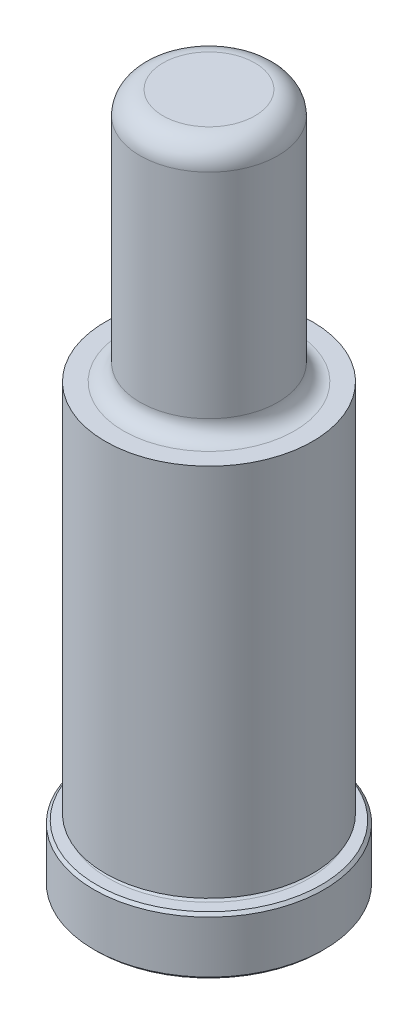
from build123d import *

# Parameters (mm, degrees)
CHAMFER1_SIZE = 0.381
FILLET1_R     = 3.175


with BuildPart() as part:
    # Sketch1 → Revolve1 (revolve)
    with BuildSketch(Plane(origin=(0, 0, 0), x_dir=(0, 0, -1), z_dir=(1, 0, 0)), mode=Mode.PRIVATE) as revolve1_sk:
        with BuildLine():
            Line((0, 0), (15.875, 0))
            Line((15.875, 0), (15.875, 7.9248))
            Line((15.875, 7.9248), (13.8938, 7.9248))
            ThreePointArc((13.8938, 7.9248), (13.5128, 8.3058), (13.8938, 8.6868))
            Line((13.8938, 8.6868), (14.3002, 8.6868))
            Line((14.3002, 8.6868), (14.3002, 60.325))
            Line((14.3002, 60.325), (11.7983, 60.325))
            ThreePointArc((11.7983, 60.325), (10.181853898, 60.994553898), (9.5123, 62.611))
            Line((9.5123, 62.611), (9.5123, 95.25))
            Line((9.5123, 95.25), (0, 95.25))
            Line((0, 95.25), (0, 0))
        make_face()
    revolve(revolve1_sk.sketch.rotate(Axis((0, 0, 0), (0, -1, 0)), 180), axis=Axis((0, 0, 0), (0, -1, 0)))

    # Chamfer1
    chamfer1_edges = [part.edges().sort_by_distance(p)[0] for p in [
        (0, 7.9248, -15.875),
        (0, 0, -15.875),
    ]]
    chamfer(chamfer1_edges, length=CHAMFER1_SIZE)

    # Fillet1
    fillet1_edges = [part.edges().sort_by_distance(p)[0] for p in [
        (0, 95.25, -9.5123),
    ]]
    fillet(fillet1_edges, radius=FILLET1_R)


solid = part.part
